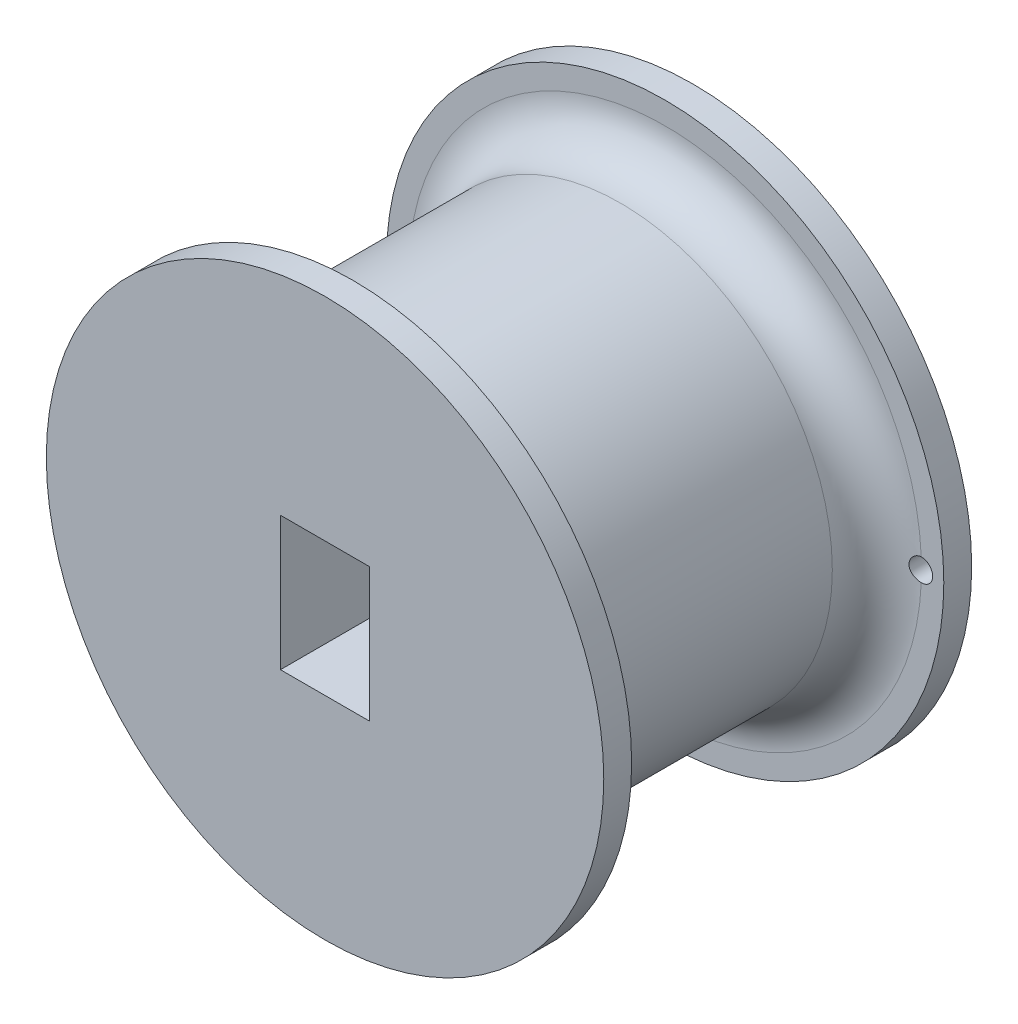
from build123d import *

# Parameters (mm, degrees)
CROQUIS1_R              = 25
CROQUIS1_W              = 8
CROQUIS1_H              = 12
SALIENTE_EXTRUIR1_DEPTH = 2.5
CROQUIS2_R              = 19
CROQUIS2_W              = 8
CROQUIS2_H              = 12
SALIENTE_EXTRUIR2_DEPTH = 28
CROQUIS3_R              = 25
CROQUIS3_R_2            = 19
CROQUIS3_W              = 8
CROQUIS3_H              = 12
SALIENTE_EXTRUIR3_DEPTH = 2.5
REDONDEO1_R             = 4
CROQUIS7_R              = 1.5
CORTAR_EXTRUIR2_DEPTH   = 10
CROQUIS8_R              = 1
CORTAR_EXTRUIR3_DEPTH   = 10


with BuildPart() as part:
    # Croquis1 → Saliente-Extruir1 (new body)
    with BuildSketch(Plane.XY):
        Circle(CROQUIS1_R)
        Rectangle(CROQUIS1_W, CROQUIS1_H, mode=Mode.SUBTRACT)
    extrude(amount=SALIENTE_EXTRUIR1_DEPTH)

    # Croquis2 → Saliente-Extruir2 (add)
    with BuildSketch(Plane.XY.offset(2.5)):
        Circle(CROQUIS2_R)
        Rectangle(CROQUIS2_W, CROQUIS2_H, mode=Mode.SUBTRACT)
    extrude(amount=SALIENTE_EXTRUIR2_DEPTH)

    # Croquis3 → Saliente-Extruir3 (add)
    # profile 1 of 2: a face of its own
    with BuildSketch(Plane.XY.offset(30.5)):
        Circle(CROQUIS3_R)
        Circle(CROQUIS3_R_2, mode=Mode.SUBTRACT)
    # profile 2 of 2: a face of its own
    with BuildSketch(Plane.XY.offset(30.5)):
        Circle(CROQUIS3_R_2)
        Rectangle(CROQUIS3_W, CROQUIS3_H, mode=Mode.SUBTRACT)
    extrude(amount=SALIENTE_EXTRUIR3_DEPTH)

    # Redondeo1
    redondeo1_edges = [part.edges().sort_by_distance(p)[0] for p in [
        (-19, 0, 30.5),
        (-19, 0, 2.5),
    ]]
    fillet(redondeo1_edges, radius=REDONDEO1_R)

    # Croquis7 → Cortar-Extruir2 (cut)
    with BuildSketch(Plane(origin=(0, 0, 0), x_dir=(-1, 0, 0), z_dir=(0, 0, -1))):
        with Locations((0, 15)):
            Circle(CROQUIS7_R)
        with Locations((0, -15)):
            Circle(CROQUIS7_R)
    extrude(amount=-CORTAR_EXTRUIR2_DEPTH, mode=Mode.SUBTRACT)

    # Croquis8 → Cortar-Extruir3 (cut)
    with BuildSketch(Plane(origin=(0, 0, 0), x_dir=(-1, 0, 0), z_dir=(0, 0, -1))):
        with Locations((-23, 0)):
            Circle(CROQUIS8_R)
    cortar_extruir3 = extrude(amount=-CORTAR_EXTRUIR3_DEPTH, mode=Mode.SUBTRACT)

    # Simetr_a1: Cortar-Extruir3 across plane
    add(cortar_extruir3.mirror(Plane(origin=(0, 0, 0), x_dir=(0, 0, 1), z_dir=(1, 0, 0))), mode=Mode.SUBTRACT)


solid = part.part
